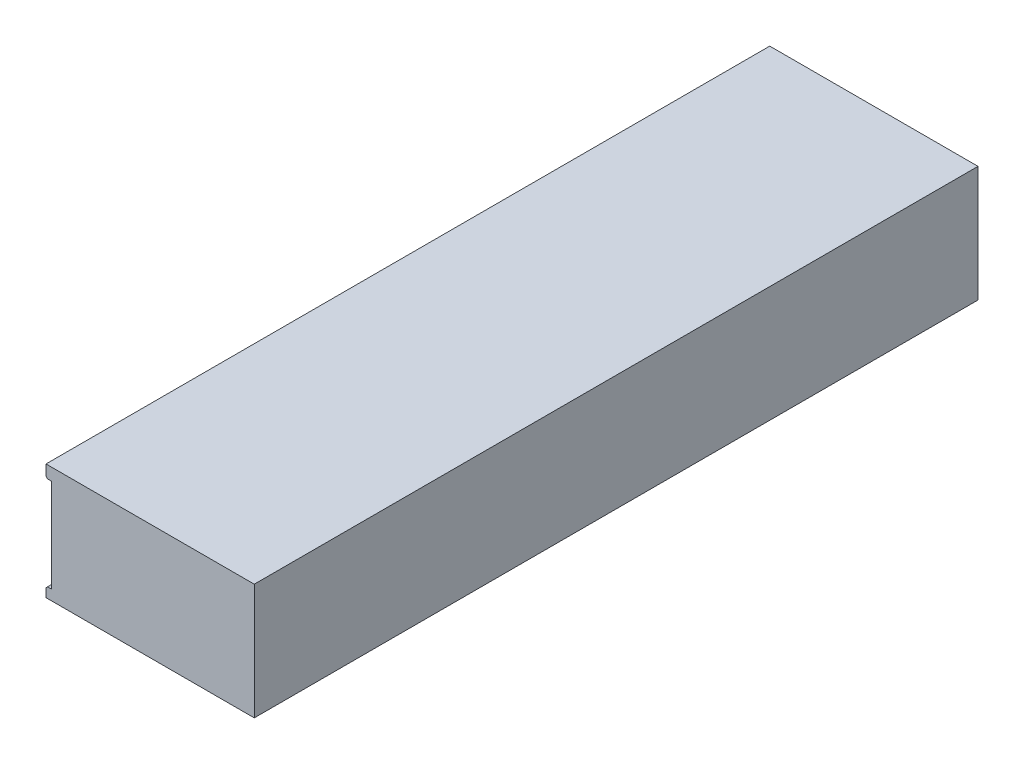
from build123d import *

# Parameters (mm, degrees)
EXTRUDE1_DEPTH                   = 90.4748
F_10_32_TAPPED_HOLE1_D           = 4.0386
F_10_32_TAPPED_HOLE1_DEPTH       = 9.99744
F_10_32_TAPPED_HOLE1_CBORE_D     = 4.826
F_10_32_TAPPED_HOLE1_CBORE_DEPTH = 7.62
F_10_32_TAPPED_HOLE1_TIP         = 1.213317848
CHAMFER1_SIZE                    = 0.381


with BuildPart() as part:
    # Sketch1 → Extrude1 (new, symmetric)
    with BuildSketch(Plane.XY):
        Polygon((50.673, 0), (50.673, -28.956), (-1.397, -28.956), (-1.397, -26.416), (0, -26.416), (0, -3.048), (-1.397, -3.048), (-1.397, 0), align=None)
    extrude(amount=EXTRUDE1_DEPTH, both=True)

    # 10-32 Tapped Hole1
    with Locations(Plane(origin=(0, -6.35, -85.598), x_dir=(0, 0, -1), z_dir=(-1, 0, 0))):
        with Locations((0, 0), (-171.196, 0), (-90.4748, 0), (-80.7212, 0), (0, 16.764), (-80.7212, 16.764), (-90.4748, 16.764), (-171.196, 16.764)):
            CounterBoreHole(F_10_32_TAPPED_HOLE1_D / 2, F_10_32_TAPPED_HOLE1_CBORE_D / 2, F_10_32_TAPPED_HOLE1_CBORE_DEPTH, depth=F_10_32_TAPPED_HOLE1_DEPTH)
            with Locations((0, 0, -(F_10_32_TAPPED_HOLE1_DEPTH + F_10_32_TAPPED_HOLE1_TIP / 2))):  # 118° drill point
                Cone(0, F_10_32_TAPPED_HOLE1_D / 2, F_10_32_TAPPED_HOLE1_TIP, mode=Mode.SUBTRACT)

    # Chamfer1
    chamfer1_edges = [part.edges().sort_by_distance(p)[0] for p in [
        (-1.397, -26.416, 0),
        (-1.397, -3.048, 0),
    ]]
    chamfer(chamfer1_edges, length=CHAMFER1_SIZE)


solid = part.part
